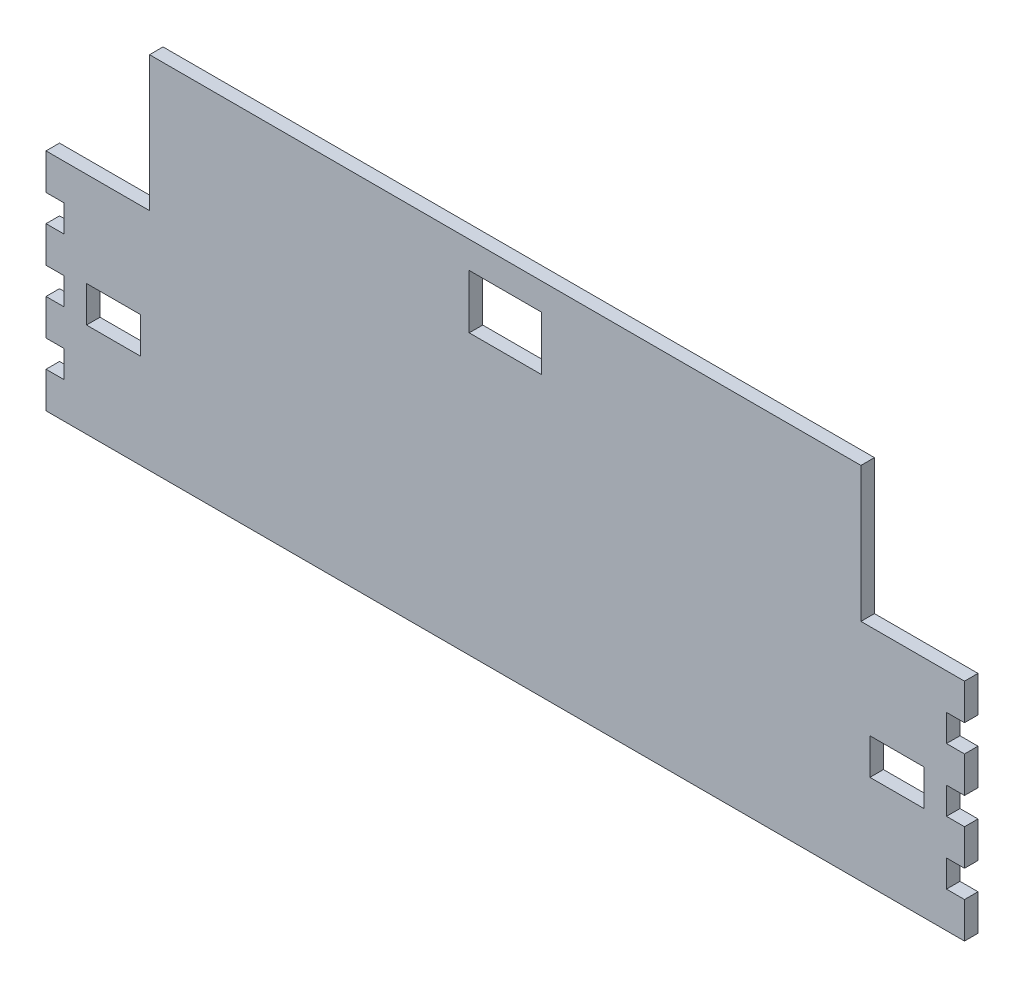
ISO-10303-21;
HEADER;
FILE_DESCRIPTION(('STEP AP214'),'2;1');
FILE_NAME('part.step','',(''),(''),'','','');
FILE_SCHEMA(('AUTOMOTIVE_DESIGN { 1 0 10303 214 1 1 1 1 }'));
ENDSEC;
DATA;
#1=APPLICATION_CONTEXT('core data for automotive mechanical design processes');
#2=APPLICATION_PROTOCOL_DEFINITION('international standard','automotive_design',2000,#1);
#3=PRODUCT_CONTEXT('',#1,'mechanical');
#4=PRODUCT('Part','Part','',(#3));
#5=PRODUCT_RELATED_PRODUCT_CATEGORY('part','',(#4));
#6=PRODUCT_DEFINITION_FORMATION('','',#4);
#7=PRODUCT_DEFINITION_CONTEXT('part definition',#1,'design');
#8=PRODUCT_DEFINITION('design','',#6,#7);
#9=PRODUCT_DEFINITION_SHAPE('','',#8);
#10=(LENGTH_UNIT() NAMED_UNIT(*) SI_UNIT(.MILLI.,.METRE.));
#11=(NAMED_UNIT(*) PLANE_ANGLE_UNIT() SI_UNIT($,.RADIAN.));
#12=(NAMED_UNIT(*) SI_UNIT($,.STERADIAN.) SOLID_ANGLE_UNIT());
#13=UNCERTAINTY_MEASURE_WITH_UNIT(LENGTH_MEASURE(1.E-05),#10,'distance_accuracy_value','');
#14=(GEOMETRIC_REPRESENTATION_CONTEXT(3) GLOBAL_UNCERTAINTY_ASSIGNED_CONTEXT((#13)) GLOBAL_UNIT_ASSIGNED_CONTEXT((#10,
#11,#12)) REPRESENTATION_CONTEXT('',''));
#15=CARTESIAN_POINT('',(0.,0.,0.));
#16=DIRECTION('',(0.,0.,1.));
#17=DIRECTION('',(1.,0.,0.));
#18=AXIS2_PLACEMENT_3D('',#15,#16,#17);
#19=CARTESIAN_POINT('',(510.,70.,15.));
#20=DIRECTION('',(0.,0.,1.));
#21=DIRECTION('',(1.,0.,0.));
#22=AXIS2_PLACEMENT_3D('',#19,#20,#21);
#23=PLANE('',#22);
#24=DIRECTION('',(1.,0.,0.));
#25=VECTOR('',#24,1.);
#26=CARTESIAN_POINT('',(-465.,105.,15.));
#27=LINE('',#26,#25);
#28=CARTESIAN_POINT('',(-465.,105.,15.));
#29=VERTEX_POINT('',#28);
#30=CARTESIAN_POINT('',(-405.,105.,15.));
#31=VERTEX_POINT('',#30);
#32=EDGE_CURVE('E360',#29,#31,#27,.T.);
#33=ORIENTED_EDGE('',*,*,#32,.F.);
#34=DIRECTION('',(0.,-1.,0.));
#35=VECTOR('',#34,1.);
#36=CARTESIAN_POINT('',(-465.,145.,15.));
#37=LINE('',#36,#35);
#38=CARTESIAN_POINT('',(-465.,145.,15.));
#39=VERTEX_POINT('',#38);
#40=EDGE_CURVE('E358',#39,#29,#37,.T.);
#41=ORIENTED_EDGE('',*,*,#40,.F.);
#42=DIRECTION('',(-1.,0.,0.));
#43=VECTOR('',#42,1.);
#44=CARTESIAN_POINT('',(-465.,145.,15.));
#45=LINE('',#44,#43);
#46=CARTESIAN_POINT('',(-405.,145.,15.));
#47=VERTEX_POINT('',#46);
#48=EDGE_CURVE('E365',#47,#39,#45,.T.);
#49=ORIENTED_EDGE('',*,*,#48,.F.);
#50=DIRECTION('',(0.,1.,0.));
#51=VECTOR('',#50,1.);
#52=CARTESIAN_POINT('',(-405.,145.,15.));
#53=LINE('',#52,#51);
#54=EDGE_CURVE('E362',#31,#47,#53,.T.);
#55=ORIENTED_EDGE('',*,*,#54,.F.);
#56=EDGE_LOOP('',(#33,#41,#49,#55));
#57=FACE_BOUND('',#56,.T.);
#58=DIRECTION('',(1.,0.,0.));
#59=VECTOR('',#58,1.);
#60=CARTESIAN_POINT('',(490.,70.,15.));
#61=LINE('',#60,#59);
#62=CARTESIAN_POINT('',(490.,70.,15.));
#63=VERTEX_POINT('',#62);
#64=CARTESIAN_POINT('',(510.,70.,15.));
#65=VERTEX_POINT('',#64);
#66=EDGE_CURVE('E473',#63,#65,#61,.T.);
#67=ORIENTED_EDGE('',*,*,#66,.T.);
#68=DIRECTION('',(0.,1.,0.));
#69=VECTOR('',#68,1.);
#70=CARTESIAN_POINT('',(510.,70.,15.));
#71=LINE('',#70,#69);
#72=CARTESIAN_POINT('',(510.,110.,15.));
#73=VERTEX_POINT('',#72);
#74=EDGE_CURVE('E476',#65,#73,#71,.T.);
#75=ORIENTED_EDGE('',*,*,#74,.T.);
#76=DIRECTION('',(-1.,0.,0.));
#77=VECTOR('',#76,1.);
#78=CARTESIAN_POINT('',(510.,110.,15.));
#79=LINE('',#78,#77);
#80=CARTESIAN_POINT('',(490.,110.,15.));
#81=VERTEX_POINT('',#80);
#82=EDGE_CURVE('E478',#73,#81,#79,.T.);
#83=ORIENTED_EDGE('',*,*,#82,.T.);
#84=DIRECTION('',(0.,1.,0.));
#85=VECTOR('',#84,1.);
#86=CARTESIAN_POINT('',(490.,110.,15.));
#87=LINE('',#86,#85);
#88=CARTESIAN_POINT('',(490.,140.,15.));
#89=VERTEX_POINT('',#88);
#90=EDGE_CURVE('E480',#81,#89,#87,.T.);
#91=ORIENTED_EDGE('',*,*,#90,.T.);
#92=DIRECTION('',(1.,0.,0.));
#93=VECTOR('',#92,1.);
#94=CARTESIAN_POINT('',(490.,140.,15.));
#95=LINE('',#94,#93);
#96=CARTESIAN_POINT('',(510.,140.,15.));
#97=VERTEX_POINT('',#96);
#98=EDGE_CURVE('E482',#89,#97,#95,.T.);
#99=ORIENTED_EDGE('',*,*,#98,.T.);
#100=DIRECTION('',(0.,1.,0.));
#101=VECTOR('',#100,1.);
#102=CARTESIAN_POINT('',(510.,140.,15.));
#103=LINE('',#102,#101);
#104=CARTESIAN_POINT('',(510.,180.,15.));
#105=VERTEX_POINT('',#104);
#106=EDGE_CURVE('E484',#97,#105,#103,.T.);
#107=ORIENTED_EDGE('',*,*,#106,.T.);
#108=DIRECTION('',(-1.,0.,0.));
#109=VECTOR('',#108,1.);
#110=CARTESIAN_POINT('',(510.,180.,15.));
#111=LINE('',#110,#109);
#112=CARTESIAN_POINT('',(490.,180.,15.));
#113=VERTEX_POINT('',#112);
#114=EDGE_CURVE('E486',#105,#113,#111,.T.);
#115=ORIENTED_EDGE('',*,*,#114,.T.);
#116=DIRECTION('',(0.,1.,0.));
#117=VECTOR('',#116,1.);
#118=CARTESIAN_POINT('',(490.,180.,15.));
#119=LINE('',#118,#117);
#120=CARTESIAN_POINT('',(490.,210.,15.));
#121=VERTEX_POINT('',#120);
#122=EDGE_CURVE('E488',#113,#121,#119,.T.);
#123=ORIENTED_EDGE('',*,*,#122,.T.);
#124=DIRECTION('',(1.,0.,0.));
#125=VECTOR('',#124,1.);
#126=CARTESIAN_POINT('',(490.,210.,15.));
#127=LINE('',#126,#125);
#128=CARTESIAN_POINT('',(510.,210.,15.));
#129=VERTEX_POINT('',#128);
#130=EDGE_CURVE('E490',#121,#129,#127,.T.);
#131=ORIENTED_EDGE('',*,*,#130,.T.);
#132=DIRECTION('',(0.,1.,0.));
#133=VECTOR('',#132,1.);
#134=CARTESIAN_POINT('',(510.,210.,15.));
#135=LINE('',#134,#133);
#136=CARTESIAN_POINT('',(510.,250.,15.));
#137=VERTEX_POINT('',#136);
#138=EDGE_CURVE('E492',#129,#137,#135,.T.);
#139=ORIENTED_EDGE('',*,*,#138,.T.);
#140=DIRECTION('',(-1.,0.,0.));
#141=VECTOR('',#140,1.);
#142=CARTESIAN_POINT('',(510.,250.,15.));
#143=LINE('',#142,#141);
#144=CARTESIAN_POINT('',(395.,250.,15.));
#145=VERTEX_POINT('',#144);
#146=EDGE_CURVE('E494',#137,#145,#143,.T.);
#147=ORIENTED_EDGE('',*,*,#146,.T.);
#148=DIRECTION('',(0.,1.,0.));
#149=VECTOR('',#148,1.);
#150=CARTESIAN_POINT('',(395.,250.,15.));
#151=LINE('',#150,#149);
#152=CARTESIAN_POINT('',(395.,400.,15.));
#153=VERTEX_POINT('',#152);
#154=EDGE_CURVE('E496',#145,#153,#151,.T.);
#155=ORIENTED_EDGE('',*,*,#154,.T.);
#156=DIRECTION('',(-1.,0.,0.));
#157=VECTOR('',#156,1.);
#158=CARTESIAN_POINT('',(395.,400.,15.));
#159=LINE('',#158,#157);
#160=CARTESIAN_POINT('',(-395.,400.,15.));
#161=VERTEX_POINT('',#160);
#162=EDGE_CURVE('E498',#153,#161,#159,.T.);
#163=ORIENTED_EDGE('',*,*,#162,.T.);
#164=DIRECTION('',(0.,-1.,0.));
#165=VECTOR('',#164,1.);
#166=CARTESIAN_POINT('',(-395.,250.,15.));
#167=LINE('',#166,#165);
#168=CARTESIAN_POINT('',(-395.,250.,15.));
#169=VERTEX_POINT('',#168);
#170=EDGE_CURVE('E500',#161,#169,#167,.T.);
#171=ORIENTED_EDGE('',*,*,#170,.T.);
#172=DIRECTION('',(-1.,0.,0.));
#173=VECTOR('',#172,1.);
#174=CARTESIAN_POINT('',(-510.,250.,15.));
#175=LINE('',#174,#173);
#176=CARTESIAN_POINT('',(-510.,250.,15.));
#177=VERTEX_POINT('',#176);
#178=EDGE_CURVE('E502',#169,#177,#175,.T.);
#179=ORIENTED_EDGE('',*,*,#178,.T.);
#180=DIRECTION('',(0.,-1.,0.));
#181=VECTOR('',#180,1.);
#182=CARTESIAN_POINT('',(-510.,210.,15.));
#183=LINE('',#182,#181);
#184=CARTESIAN_POINT('',(-510.,210.,15.));
#185=VERTEX_POINT('',#184);
#186=EDGE_CURVE('E504',#177,#185,#183,.T.);
#187=ORIENTED_EDGE('',*,*,#186,.T.);
#188=DIRECTION('',(1.,0.,0.));
#189=VECTOR('',#188,1.);
#190=CARTESIAN_POINT('',(-490.,210.,15.));
#191=LINE('',#190,#189);
#192=CARTESIAN_POINT('',(-490.,210.,15.));
#193=VERTEX_POINT('',#192);
#194=EDGE_CURVE('E506',#185,#193,#191,.T.);
#195=ORIENTED_EDGE('',*,*,#194,.T.);
#196=DIRECTION('',(0.,-1.,0.));
#197=VECTOR('',#196,1.);
#198=CARTESIAN_POINT('',(-490.,180.,15.));
#199=LINE('',#198,#197);
#200=CARTESIAN_POINT('',(-490.,180.,15.));
#201=VERTEX_POINT('',#200);
#202=EDGE_CURVE('E508',#193,#201,#199,.T.);
#203=ORIENTED_EDGE('',*,*,#202,.T.);
#204=DIRECTION('',(-1.,0.,0.));
#205=VECTOR('',#204,1.);
#206=CARTESIAN_POINT('',(-510.,180.,15.));
#207=LINE('',#206,#205);
#208=CARTESIAN_POINT('',(-510.,180.,15.));
#209=VERTEX_POINT('',#208);
#210=EDGE_CURVE('E510',#201,#209,#207,.T.);
#211=ORIENTED_EDGE('',*,*,#210,.T.);
#212=DIRECTION('',(0.,-1.,0.));
#213=VECTOR('',#212,1.);
#214=CARTESIAN_POINT('',(-510.,140.,15.));
#215=LINE('',#214,#213);
#216=CARTESIAN_POINT('',(-510.,140.,15.));
#217=VERTEX_POINT('',#216);
#218=EDGE_CURVE('E512',#209,#217,#215,.T.);
#219=ORIENTED_EDGE('',*,*,#218,.T.);
#220=DIRECTION('',(1.,0.,0.));
#221=VECTOR('',#220,1.);
#222=CARTESIAN_POINT('',(-490.,140.,15.));
#223=LINE('',#222,#221);
#224=CARTESIAN_POINT('',(-490.,140.,15.));
#225=VERTEX_POINT('',#224);
#226=EDGE_CURVE('E514',#217,#225,#223,.T.);
#227=ORIENTED_EDGE('',*,*,#226,.T.);
#228=DIRECTION('',(0.,-1.,0.));
#229=VECTOR('',#228,1.);
#230=CARTESIAN_POINT('',(-490.,110.,15.));
#231=LINE('',#230,#229);
#232=CARTESIAN_POINT('',(-490.,110.,15.));
#233=VERTEX_POINT('',#232);
#234=EDGE_CURVE('E516',#225,#233,#231,.T.);
#235=ORIENTED_EDGE('',*,*,#234,.T.);
#236=DIRECTION('',(-1.,0.,0.));
#237=VECTOR('',#236,1.);
#238=CARTESIAN_POINT('',(-510.,110.,15.));
#239=LINE('',#238,#237);
#240=CARTESIAN_POINT('',(-510.,110.,15.));
#241=VERTEX_POINT('',#240);
#242=EDGE_CURVE('E518',#233,#241,#239,.T.);
#243=ORIENTED_EDGE('',*,*,#242,.T.);
#244=DIRECTION('',(0.,-1.,0.));
#245=VECTOR('',#244,1.);
#246=CARTESIAN_POINT('',(-510.,70.,15.));
#247=LINE('',#246,#245);
#248=CARTESIAN_POINT('',(-510.,70.,15.));
#249=VERTEX_POINT('',#248);
#250=EDGE_CURVE('E520',#241,#249,#247,.T.);
#251=ORIENTED_EDGE('',*,*,#250,.T.);
#252=DIRECTION('',(1.,0.,0.));
#253=VECTOR('',#252,1.);
#254=CARTESIAN_POINT('',(-490.,70.,15.));
#255=LINE('',#254,#253);
#256=CARTESIAN_POINT('',(-490.,70.,15.));
#257=VERTEX_POINT('',#256);
#258=EDGE_CURVE('E522',#249,#257,#255,.T.);
#259=ORIENTED_EDGE('',*,*,#258,.T.);
#260=DIRECTION('',(0.,-1.,0.));
#261=VECTOR('',#260,1.);
#262=CARTESIAN_POINT('',(-490.,40.,15.));
#263=LINE('',#262,#261);
#264=CARTESIAN_POINT('',(-490.,40.,15.));
#265=VERTEX_POINT('',#264);
#266=EDGE_CURVE('E524',#257,#265,#263,.T.);
#267=ORIENTED_EDGE('',*,*,#266,.T.);
#268=DIRECTION('',(-1.,0.,0.));
#269=VECTOR('',#268,1.);
#270=CARTESIAN_POINT('',(-510.,40.,15.));
#271=LINE('',#270,#269);
#272=CARTESIAN_POINT('',(-510.,40.,15.));
#273=VERTEX_POINT('',#272);
#274=EDGE_CURVE('E526',#265,#273,#271,.T.);
#275=ORIENTED_EDGE('',*,*,#274,.T.);
#276=DIRECTION('',(0.,-1.,0.));
#277=VECTOR('',#276,1.);
#278=CARTESIAN_POINT('',(-510.,0.,15.));
#279=LINE('',#278,#277);
#280=CARTESIAN_POINT('',(-510.,0.,15.));
#281=VERTEX_POINT('',#280);
#282=EDGE_CURVE('E528',#273,#281,#279,.T.);
#283=ORIENTED_EDGE('',*,*,#282,.T.);
#284=DIRECTION('',(1.,0.,0.));
#285=VECTOR('',#284,1.);
#286=CARTESIAN_POINT('',(-510.,0.,15.));
#287=LINE('',#286,#285);
#288=CARTESIAN_POINT('',(510.,0.,15.));
#289=VERTEX_POINT('',#288);
#290=EDGE_CURVE('E530',#281,#289,#287,.T.);
#291=ORIENTED_EDGE('',*,*,#290,.T.);
#292=DIRECTION('',(0.,1.,0.));
#293=VECTOR('',#292,1.);
#294=CARTESIAN_POINT('',(510.,0.,15.));
#295=LINE('',#294,#293);
#296=CARTESIAN_POINT('',(510.,40.,15.));
#297=VERTEX_POINT('',#296);
#298=EDGE_CURVE('E532',#289,#297,#295,.T.);
#299=ORIENTED_EDGE('',*,*,#298,.T.);
#300=DIRECTION('',(-1.,0.,0.));
#301=VECTOR('',#300,1.);
#302=CARTESIAN_POINT('',(510.,40.,15.));
#303=LINE('',#302,#301);
#304=CARTESIAN_POINT('',(490.,40.,15.));
#305=VERTEX_POINT('',#304);
#306=EDGE_CURVE('E534',#297,#305,#303,.T.);
#307=ORIENTED_EDGE('',*,*,#306,.T.);
#308=DIRECTION('',(0.,1.,0.));
#309=VECTOR('',#308,1.);
#310=CARTESIAN_POINT('',(490.,40.,15.));
#311=LINE('',#310,#309);
#312=EDGE_CURVE('E536',#305,#63,#311,.T.);
#313=ORIENTED_EDGE('',*,*,#312,.T.);
#314=EDGE_LOOP('',(#67,#75,#83,#91,#99,#107,#115,#123,#131,#139,#147,#155,#163,#171,#179,#187,
#195,#203,#211,#219,#227,#235,#243,#251,#259,#267,#275,#283,#291,#299,#307,#313));
#315=FACE_BOUND('',#314,.T.);
#316=DIRECTION('',(1.,0.,0.));
#317=VECTOR('',#316,1.);
#318=CARTESIAN_POINT('',(-40.,310.,15.));
#319=LINE('',#318,#317);
#320=CARTESIAN_POINT('',(-40.,310.,15.));
#321=VERTEX_POINT('',#320);
#322=CARTESIAN_POINT('',(40.,310.,15.));
#323=VERTEX_POINT('',#322);
#324=EDGE_CURVE('E391',#321,#323,#319,.T.);
#325=ORIENTED_EDGE('',*,*,#324,.F.);
#326=DIRECTION('',(0.,-1.,0.));
#327=VECTOR('',#326,1.);
#328=CARTESIAN_POINT('',(-40.,310.,15.));
#329=LINE('',#328,#327);
#330=CARTESIAN_POINT('',(-40.,370.,15.));
#331=VERTEX_POINT('',#330);
#332=EDGE_CURVE('E389',#331,#321,#329,.T.);
#333=ORIENTED_EDGE('',*,*,#332,.F.);
#334=DIRECTION('',(-1.,0.,0.));
#335=VECTOR('',#334,1.);
#336=CARTESIAN_POINT('',(40.,370.,15.));
#337=LINE('',#336,#335);
#338=CARTESIAN_POINT('',(40.,370.,15.));
#339=VERTEX_POINT('',#338);
#340=EDGE_CURVE('E396',#339,#331,#337,.T.);
#341=ORIENTED_EDGE('',*,*,#340,.F.);
#342=DIRECTION('',(0.,1.,0.));
#343=VECTOR('',#342,1.);
#344=CARTESIAN_POINT('',(40.,310.,15.));
#345=LINE('',#344,#343);
#346=EDGE_CURVE('E393',#323,#339,#345,.T.);
#347=ORIENTED_EDGE('',*,*,#346,.F.);
#348=EDGE_LOOP('',(#325,#333,#341,#347));
#349=FACE_BOUND('',#348,.T.);
#350=DIRECTION('',(0.,-1.,0.));
#351=VECTOR('',#350,1.);
#352=CARTESIAN_POINT('',(405.,145.,15.));
#353=LINE('',#352,#351);
#354=CARTESIAN_POINT('',(405.,145.,15.));
#355=VERTEX_POINT('',#354);
#356=CARTESIAN_POINT('',(405.,105.,15.));
#357=VERTEX_POINT('',#356);
#358=EDGE_CURVE('E337',#355,#357,#353,.T.);
#359=ORIENTED_EDGE('',*,*,#358,.F.);
#360=DIRECTION('',(-1.,0.,0.));
#361=VECTOR('',#360,1.);
#362=CARTESIAN_POINT('',(465.,145.,15.));
#363=LINE('',#362,#361);
#364=CARTESIAN_POINT('',(465.,145.,15.));
#365=VERTEX_POINT('',#364);
#366=EDGE_CURVE('E326',#365,#355,#363,.T.);
#367=ORIENTED_EDGE('',*,*,#366,.F.);
#368=DIRECTION('',(0.,1.,0.));
#369=VECTOR('',#368,1.);
#370=CARTESIAN_POINT('',(465.,145.,15.));
#371=LINE('',#370,#369);
#372=CARTESIAN_POINT('',(465.,105.,15.));
#373=VERTEX_POINT('',#372);
#374=EDGE_CURVE('E341',#373,#365,#371,.T.);
#375=ORIENTED_EDGE('',*,*,#374,.F.);
#376=DIRECTION('',(1.,0.,0.));
#377=VECTOR('',#376,1.);
#378=CARTESIAN_POINT('',(465.,105.,15.));
#379=LINE('',#378,#377);
#380=EDGE_CURVE('E339',#357,#373,#379,.T.);
#381=ORIENTED_EDGE('',*,*,#380,.F.);
#382=EDGE_LOOP('',(#359,#367,#375,#381));
#383=FACE_BOUND('',#382,.T.);
#384=ADVANCED_FACE('F30',(#57,#315,#349,#383),#23,.T.);
#385=CARTESIAN_POINT('',(510.,70.,0.));
#386=DIRECTION('',(0.,0.,1.));
#387=DIRECTION('',(1.,0.,0.));
#388=AXIS2_PLACEMENT_3D('',#385,#386,#387);
#389=PLANE('',#388);
#390=DIRECTION('',(0.,-1.,0.));
#391=VECTOR('',#390,1.);
#392=CARTESIAN_POINT('',(-465.,145.,0.));
#393=LINE('',#392,#391);
#394=CARTESIAN_POINT('',(-465.,145.,0.));
#395=VERTEX_POINT('',#394);
#396=CARTESIAN_POINT('',(-465.,105.,0.));
#397=VERTEX_POINT('',#396);
#398=EDGE_CURVE('E327',#395,#397,#393,.T.);
#399=ORIENTED_EDGE('',*,*,#398,.T.);
#400=DIRECTION('',(1.,0.,0.));
#401=VECTOR('',#400,1.);
#402=CARTESIAN_POINT('',(-465.,105.,0.));
#403=LINE('',#402,#401);
#404=CARTESIAN_POINT('',(-405.,105.,0.));
#405=VERTEX_POINT('',#404);
#406=EDGE_CURVE('E349',#397,#405,#403,.T.);
#407=ORIENTED_EDGE('',*,*,#406,.T.);
#408=DIRECTION('',(0.,1.,0.));
#409=VECTOR('',#408,1.);
#410=CARTESIAN_POINT('',(-405.,145.,0.));
#411=LINE('',#410,#409);
#412=CARTESIAN_POINT('',(-405.,145.,0.));
#413=VERTEX_POINT('',#412);
#414=EDGE_CURVE('E352',#405,#413,#411,.T.);
#415=ORIENTED_EDGE('',*,*,#414,.T.);
#416=DIRECTION('',(-1.,0.,0.));
#417=VECTOR('',#416,1.);
#418=CARTESIAN_POINT('',(-465.,145.,0.));
#419=LINE('',#418,#417);
#420=EDGE_CURVE('E355',#413,#395,#419,.T.);
#421=ORIENTED_EDGE('',*,*,#420,.T.);
#422=EDGE_LOOP('',(#399,#407,#415,#421));
#423=FACE_BOUND('',#422,.T.);
#424=DIRECTION('',(1.,0.,0.));
#425=VECTOR('',#424,1.);
#426=CARTESIAN_POINT('',(490.,70.,0.));
#427=LINE('',#426,#425);
#428=CARTESIAN_POINT('',(490.,70.,0.));
#429=VERTEX_POINT('',#428);
#430=CARTESIAN_POINT('',(510.,70.,0.));
#431=VERTEX_POINT('',#430);
#432=EDGE_CURVE('E408',#429,#431,#427,.T.);
#433=ORIENTED_EDGE('',*,*,#432,.F.);
#434=DIRECTION('',(0.,1.,0.));
#435=VECTOR('',#434,1.);
#436=CARTESIAN_POINT('',(490.,40.,0.));
#437=LINE('',#436,#435);
#438=CARTESIAN_POINT('',(490.,40.,0.));
#439=VERTEX_POINT('',#438);
#440=EDGE_CURVE('E471',#439,#429,#437,.T.);
#441=ORIENTED_EDGE('',*,*,#440,.F.);
#442=DIRECTION('',(-1.,0.,0.));
#443=VECTOR('',#442,1.);
#444=CARTESIAN_POINT('',(510.,40.,0.));
#445=LINE('',#444,#443);
#446=CARTESIAN_POINT('',(510.,40.,0.));
#447=VERTEX_POINT('',#446);
#448=EDGE_CURVE('E469',#447,#439,#445,.T.);
#449=ORIENTED_EDGE('',*,*,#448,.F.);
#450=DIRECTION('',(0.,1.,0.));
#451=VECTOR('',#450,1.);
#452=CARTESIAN_POINT('',(510.,0.,0.));
#453=LINE('',#452,#451);
#454=CARTESIAN_POINT('',(510.,0.,0.));
#455=VERTEX_POINT('',#454);
#456=EDGE_CURVE('E467',#455,#447,#453,.T.);
#457=ORIENTED_EDGE('',*,*,#456,.F.);
#458=DIRECTION('',(1.,0.,0.));
#459=VECTOR('',#458,1.);
#460=CARTESIAN_POINT('',(-510.,0.,0.));
#461=LINE('',#460,#459);
#462=CARTESIAN_POINT('',(-510.,0.,0.));
#463=VERTEX_POINT('',#462);
#464=EDGE_CURVE('E465',#463,#455,#461,.T.);
#465=ORIENTED_EDGE('',*,*,#464,.F.);
#466=DIRECTION('',(0.,-1.,0.));
#467=VECTOR('',#466,1.);
#468=CARTESIAN_POINT('',(-510.,0.,0.));
#469=LINE('',#468,#467);
#470=CARTESIAN_POINT('',(-510.,40.,0.));
#471=VERTEX_POINT('',#470);
#472=EDGE_CURVE('E463',#471,#463,#469,.T.);
#473=ORIENTED_EDGE('',*,*,#472,.F.);
#474=DIRECTION('',(-1.,0.,0.));
#475=VECTOR('',#474,1.);
#476=CARTESIAN_POINT('',(-510.,40.,0.));
#477=LINE('',#476,#475);
#478=CARTESIAN_POINT('',(-490.,40.,0.));
#479=VERTEX_POINT('',#478);
#480=EDGE_CURVE('E461',#479,#471,#477,.T.);
#481=ORIENTED_EDGE('',*,*,#480,.F.);
#482=DIRECTION('',(0.,-1.,0.));
#483=VECTOR('',#482,1.);
#484=CARTESIAN_POINT('',(-490.,40.,0.));
#485=LINE('',#484,#483);
#486=CARTESIAN_POINT('',(-490.,70.,0.));
#487=VERTEX_POINT('',#486);
#488=EDGE_CURVE('E459',#487,#479,#485,.T.);
#489=ORIENTED_EDGE('',*,*,#488,.F.);
#490=DIRECTION('',(1.,0.,0.));
#491=VECTOR('',#490,1.);
#492=CARTESIAN_POINT('',(-490.,70.,0.));
#493=LINE('',#492,#491);
#494=CARTESIAN_POINT('',(-510.,70.,0.));
#495=VERTEX_POINT('',#494);
#496=EDGE_CURVE('E457',#495,#487,#493,.T.);
#497=ORIENTED_EDGE('',*,*,#496,.F.);
#498=DIRECTION('',(0.,-1.,0.));
#499=VECTOR('',#498,1.);
#500=CARTESIAN_POINT('',(-510.,70.,0.));
#501=LINE('',#500,#499);
#502=CARTESIAN_POINT('',(-510.,110.,0.));
#503=VERTEX_POINT('',#502);
#504=EDGE_CURVE('E455',#503,#495,#501,.T.);
#505=ORIENTED_EDGE('',*,*,#504,.F.);
#506=DIRECTION('',(-1.,0.,0.));
#507=VECTOR('',#506,1.);
#508=CARTESIAN_POINT('',(-510.,110.,0.));
#509=LINE('',#508,#507);
#510=CARTESIAN_POINT('',(-490.,110.,0.));
#511=VERTEX_POINT('',#510);
#512=EDGE_CURVE('E453',#511,#503,#509,.T.);
#513=ORIENTED_EDGE('',*,*,#512,.F.);
#514=DIRECTION('',(0.,-1.,0.));
#515=VECTOR('',#514,1.);
#516=CARTESIAN_POINT('',(-490.,110.,0.));
#517=LINE('',#516,#515);
#518=CARTESIAN_POINT('',(-490.,140.,0.));
#519=VERTEX_POINT('',#518);
#520=EDGE_CURVE('E451',#519,#511,#517,.T.);
#521=ORIENTED_EDGE('',*,*,#520,.F.);
#522=DIRECTION('',(1.,0.,0.));
#523=VECTOR('',#522,1.);
#524=CARTESIAN_POINT('',(-490.,140.,0.));
#525=LINE('',#524,#523);
#526=CARTESIAN_POINT('',(-510.,140.,0.));
#527=VERTEX_POINT('',#526);
#528=EDGE_CURVE('E449',#527,#519,#525,.T.);
#529=ORIENTED_EDGE('',*,*,#528,.F.);
#530=DIRECTION('',(0.,-1.,0.));
#531=VECTOR('',#530,1.);
#532=CARTESIAN_POINT('',(-510.,140.,0.));
#533=LINE('',#532,#531);
#534=CARTESIAN_POINT('',(-510.,180.,0.));
#535=VERTEX_POINT('',#534);
#536=EDGE_CURVE('E447',#535,#527,#533,.T.);
#537=ORIENTED_EDGE('',*,*,#536,.F.);
#538=DIRECTION('',(-1.,0.,0.));
#539=VECTOR('',#538,1.);
#540=CARTESIAN_POINT('',(-510.,180.,0.));
#541=LINE('',#540,#539);
#542=CARTESIAN_POINT('',(-490.,180.,0.));
#543=VERTEX_POINT('',#542);
#544=EDGE_CURVE('E445',#543,#535,#541,.T.);
#545=ORIENTED_EDGE('',*,*,#544,.F.);
#546=DIRECTION('',(0.,-1.,0.));
#547=VECTOR('',#546,1.);
#548=CARTESIAN_POINT('',(-490.,180.,0.));
#549=LINE('',#548,#547);
#550=CARTESIAN_POINT('',(-490.,210.,0.));
#551=VERTEX_POINT('',#550);
#552=EDGE_CURVE('E443',#551,#543,#549,.T.);
#553=ORIENTED_EDGE('',*,*,#552,.F.);
#554=DIRECTION('',(1.,0.,0.));
#555=VECTOR('',#554,1.);
#556=CARTESIAN_POINT('',(-490.,210.,0.));
#557=LINE('',#556,#555);
#558=CARTESIAN_POINT('',(-510.,210.,0.));
#559=VERTEX_POINT('',#558);
#560=EDGE_CURVE('E441',#559,#551,#557,.T.);
#561=ORIENTED_EDGE('',*,*,#560,.F.);
#562=DIRECTION('',(0.,-1.,0.));
#563=VECTOR('',#562,1.);
#564=CARTESIAN_POINT('',(-510.,210.,0.));
#565=LINE('',#564,#563);
#566=CARTESIAN_POINT('',(-510.,250.,0.));
#567=VERTEX_POINT('',#566);
#568=EDGE_CURVE('E439',#567,#559,#565,.T.);
#569=ORIENTED_EDGE('',*,*,#568,.F.);
#570=DIRECTION('',(-1.,0.,0.));
#571=VECTOR('',#570,1.);
#572=CARTESIAN_POINT('',(-510.,250.,0.));
#573=LINE('',#572,#571);
#574=CARTESIAN_POINT('',(-395.,250.,0.));
#575=VERTEX_POINT('',#574);
#576=EDGE_CURVE('E437',#575,#567,#573,.T.);
#577=ORIENTED_EDGE('',*,*,#576,.F.);
#578=DIRECTION('',(0.,-1.,0.));
#579=VECTOR('',#578,1.);
#580=CARTESIAN_POINT('',(-395.,250.,0.));
#581=LINE('',#580,#579);
#582=CARTESIAN_POINT('',(-395.,400.,0.));
#583=VERTEX_POINT('',#582);
#584=EDGE_CURVE('E435',#583,#575,#581,.T.);
#585=ORIENTED_EDGE('',*,*,#584,.F.);
#586=DIRECTION('',(-1.,0.,0.));
#587=VECTOR('',#586,1.);
#588=CARTESIAN_POINT('',(395.,400.,0.));
#589=LINE('',#588,#587);
#590=CARTESIAN_POINT('',(395.,400.,0.));
#591=VERTEX_POINT('',#590);
#592=EDGE_CURVE('E433',#591,#583,#589,.T.);
#593=ORIENTED_EDGE('',*,*,#592,.F.);
#594=DIRECTION('',(0.,1.,0.));
#595=VECTOR('',#594,1.);
#596=CARTESIAN_POINT('',(395.,250.,0.));
#597=LINE('',#596,#595);
#598=CARTESIAN_POINT('',(395.,250.,0.));
#599=VERTEX_POINT('',#598);
#600=EDGE_CURVE('E431',#599,#591,#597,.T.);
#601=ORIENTED_EDGE('',*,*,#600,.F.);
#602=DIRECTION('',(-1.,0.,0.));
#603=VECTOR('',#602,1.);
#604=CARTESIAN_POINT('',(510.,250.,0.));
#605=LINE('',#604,#603);
#606=CARTESIAN_POINT('',(510.,250.,0.));
#607=VERTEX_POINT('',#606);
#608=EDGE_CURVE('E429',#607,#599,#605,.T.);
#609=ORIENTED_EDGE('',*,*,#608,.F.);
#610=DIRECTION('',(0.,1.,0.));
#611=VECTOR('',#610,1.);
#612=CARTESIAN_POINT('',(510.,210.,0.));
#613=LINE('',#612,#611);
#614=CARTESIAN_POINT('',(510.,210.,0.));
#615=VERTEX_POINT('',#614);
#616=EDGE_CURVE('E427',#615,#607,#613,.T.);
#617=ORIENTED_EDGE('',*,*,#616,.F.);
#618=DIRECTION('',(1.,0.,0.));
#619=VECTOR('',#618,1.);
#620=CARTESIAN_POINT('',(490.,210.,0.));
#621=LINE('',#620,#619);
#622=CARTESIAN_POINT('',(490.,210.,0.));
#623=VERTEX_POINT('',#622);
#624=EDGE_CURVE('E425',#623,#615,#621,.T.);
#625=ORIENTED_EDGE('',*,*,#624,.F.);
#626=DIRECTION('',(0.,1.,0.));
#627=VECTOR('',#626,1.);
#628=CARTESIAN_POINT('',(490.,180.,0.));
#629=LINE('',#628,#627);
#630=CARTESIAN_POINT('',(490.,180.,0.));
#631=VERTEX_POINT('',#630);
#632=EDGE_CURVE('E423',#631,#623,#629,.T.);
#633=ORIENTED_EDGE('',*,*,#632,.F.);
#634=DIRECTION('',(-1.,0.,0.));
#635=VECTOR('',#634,1.);
#636=CARTESIAN_POINT('',(510.,180.,0.));
#637=LINE('',#636,#635);
#638=CARTESIAN_POINT('',(510.,180.,0.));
#639=VERTEX_POINT('',#638);
#640=EDGE_CURVE('E421',#639,#631,#637,.T.);
#641=ORIENTED_EDGE('',*,*,#640,.F.);
#642=DIRECTION('',(0.,1.,0.));
#643=VECTOR('',#642,1.);
#644=CARTESIAN_POINT('',(510.,140.,0.));
#645=LINE('',#644,#643);
#646=CARTESIAN_POINT('',(510.,140.,0.));
#647=VERTEX_POINT('',#646);
#648=EDGE_CURVE('E419',#647,#639,#645,.T.);
#649=ORIENTED_EDGE('',*,*,#648,.F.);
#650=DIRECTION('',(1.,0.,0.));
#651=VECTOR('',#650,1.);
#652=CARTESIAN_POINT('',(490.,140.,0.));
#653=LINE('',#652,#651);
#654=CARTESIAN_POINT('',(490.,140.,0.));
#655=VERTEX_POINT('',#654);
#656=EDGE_CURVE('E417',#655,#647,#653,.T.);
#657=ORIENTED_EDGE('',*,*,#656,.F.);
#658=DIRECTION('',(0.,1.,0.));
#659=VECTOR('',#658,1.);
#660=CARTESIAN_POINT('',(490.,110.,0.));
#661=LINE('',#660,#659);
#662=CARTESIAN_POINT('',(490.,110.,0.));
#663=VERTEX_POINT('',#662);
#664=EDGE_CURVE('E415',#663,#655,#661,.T.);
#665=ORIENTED_EDGE('',*,*,#664,.F.);
#666=DIRECTION('',(-1.,0.,0.));
#667=VECTOR('',#666,1.);
#668=CARTESIAN_POINT('',(510.,110.,0.));
#669=LINE('',#668,#667);
#670=CARTESIAN_POINT('',(510.,110.,0.));
#671=VERTEX_POINT('',#670);
#672=EDGE_CURVE('E413',#671,#663,#669,.T.);
#673=ORIENTED_EDGE('',*,*,#672,.F.);
#674=DIRECTION('',(0.,1.,0.));
#675=VECTOR('',#674,1.);
#676=CARTESIAN_POINT('',(510.,70.,0.));
#677=LINE('',#676,#675);
#678=EDGE_CURVE('E411',#431,#671,#677,.T.);
#679=ORIENTED_EDGE('',*,*,#678,.F.);
#680=EDGE_LOOP('',(#433,#441,#449,#457,#465,#473,#481,#489,#497,#505,#513,#521,#529,#537,#545,
#553,#561,#569,#577,#585,#593,#601,#609,#617,#625,#633,#641,#649,#657,#665,#673,#679));
#681=FACE_BOUND('',#680,.T.);
#682=DIRECTION('',(0.,-1.,0.));
#683=VECTOR('',#682,1.);
#684=CARTESIAN_POINT('',(-40.,310.,0.));
#685=LINE('',#684,#683);
#686=CARTESIAN_POINT('',(-40.,370.,0.));
#687=VERTEX_POINT('',#686);
#688=CARTESIAN_POINT('',(-40.,310.,0.));
#689=VERTEX_POINT('',#688);
#690=EDGE_CURVE('E377',#687,#689,#685,.T.);
#691=ORIENTED_EDGE('',*,*,#690,.T.);
#692=DIRECTION('',(1.,0.,0.));
#693=VECTOR('',#692,1.);
#694=CARTESIAN_POINT('',(-40.,310.,0.));
#695=LINE('',#694,#693);
#696=CARTESIAN_POINT('',(40.,310.,0.));
#697=VERTEX_POINT('',#696);
#698=EDGE_CURVE('E380',#689,#697,#695,.T.);
#699=ORIENTED_EDGE('',*,*,#698,.T.);
#700=DIRECTION('',(0.,1.,0.));
#701=VECTOR('',#700,1.);
#702=CARTESIAN_POINT('',(40.,310.,0.));
#703=LINE('',#702,#701);
#704=CARTESIAN_POINT('',(40.,370.,0.));
#705=VERTEX_POINT('',#704);
#706=EDGE_CURVE('E383',#697,#705,#703,.T.);
#707=ORIENTED_EDGE('',*,*,#706,.T.);
#708=DIRECTION('',(-1.,0.,0.));
#709=VECTOR('',#708,1.);
#710=CARTESIAN_POINT('',(40.,370.,0.));
#711=LINE('',#710,#709);
#712=EDGE_CURVE('E386',#705,#687,#711,.T.);
#713=ORIENTED_EDGE('',*,*,#712,.T.);
#714=EDGE_LOOP('',(#691,#699,#707,#713));
#715=FACE_BOUND('',#714,.T.);
#716=DIRECTION('',(-1.,0.,0.));
#717=VECTOR('',#716,1.);
#718=CARTESIAN_POINT('',(465.,145.,0.));
#719=LINE('',#718,#717);
#720=CARTESIAN_POINT('',(465.,145.,0.));
#721=VERTEX_POINT('',#720);
#722=CARTESIAN_POINT('',(405.,145.,0.));
#723=VERTEX_POINT('',#722);
#724=EDGE_CURVE('E53',#721,#723,#719,.T.);
#725=ORIENTED_EDGE('',*,*,#724,.T.);
#726=DIRECTION('',(0.,-1.,0.));
#727=VECTOR('',#726,1.);
#728=CARTESIAN_POINT('',(405.,145.,0.));
#729=LINE('',#728,#727);
#730=CARTESIAN_POINT('',(405.,105.,0.));
#731=VERTEX_POINT('',#730);
#732=EDGE_CURVE('E313',#723,#731,#729,.T.);
#733=ORIENTED_EDGE('',*,*,#732,.T.);
#734=DIRECTION('',(1.,0.,0.));
#735=VECTOR('',#734,1.);
#736=CARTESIAN_POINT('',(465.,105.,0.));
#737=LINE('',#736,#735);
#738=CARTESIAN_POINT('',(465.,105.,0.));
#739=VERTEX_POINT('',#738);
#740=EDGE_CURVE('E322',#731,#739,#737,.T.);
#741=ORIENTED_EDGE('',*,*,#740,.T.);
#742=DIRECTION('',(0.,1.,0.));
#743=VECTOR('',#742,1.);
#744=CARTESIAN_POINT('',(465.,145.,0.));
#745=LINE('',#744,#743);
#746=EDGE_CURVE('E331',#739,#721,#745,.T.);
#747=ORIENTED_EDGE('',*,*,#746,.T.);
#748=EDGE_LOOP('',(#725,#733,#741,#747));
#749=FACE_BOUND('',#748,.T.);
#750=ADVANCED_FACE('F330',(#423,#681,#715,#749),#389,.F.);
#751=CARTESIAN_POINT('',(490.,70.,15.));
#752=DIRECTION('',(0.,1.,0.));
#753=DIRECTION('',(0.,0.,1.));
#754=AXIS2_PLACEMENT_3D('',#751,#752,#753);
#755=PLANE('',#754);
#756=ORIENTED_EDGE('',*,*,#432,.T.);
#757=DIRECTION('',(0.,0.,-1.));
#758=VECTOR('',#757,1.);
#759=CARTESIAN_POINT('',(510.,70.,15.));
#760=LINE('',#759,#758);
#761=EDGE_CURVE('E11',#65,#431,#760,.T.);
#762=ORIENTED_EDGE('',*,*,#761,.F.);
#763=ORIENTED_EDGE('',*,*,#66,.F.);
#764=DIRECTION('',(0.,0.,-1.));
#765=VECTOR('',#764,1.);
#766=CARTESIAN_POINT('',(490.,70.,15.));
#767=LINE('',#766,#765);
#768=EDGE_CURVE('E538',#63,#429,#767,.T.);
#769=ORIENTED_EDGE('',*,*,#768,.T.);
#770=EDGE_LOOP('',(#756,#762,#763,#769));
#771=FACE_BOUND('',#770,.T.);
#772=ADVANCED_FACE('F32',(#771),#755,.F.);
#773=CARTESIAN_POINT('',(510.,70.,15.));
#774=DIRECTION('',(-1.,0.,0.));
#775=DIRECTION('',(0.,0.,1.));
#776=AXIS2_PLACEMENT_3D('',#773,#774,#775);
#777=PLANE('',#776);
#778=ORIENTED_EDGE('',*,*,#678,.T.);
#779=DIRECTION('',(0.,0.,-1.));
#780=VECTOR('',#779,1.);
#781=CARTESIAN_POINT('',(510.,110.,15.));
#782=LINE('',#781,#780);
#783=EDGE_CURVE('E38',#73,#671,#782,.T.);
#784=ORIENTED_EDGE('',*,*,#783,.F.);
#785=ORIENTED_EDGE('',*,*,#74,.F.);
#786=ORIENTED_EDGE('',*,*,#761,.T.);
#787=EDGE_LOOP('',(#778,#784,#785,#786));
#788=FACE_BOUND('',#787,.T.);
#789=ADVANCED_FACE('F655',(#788),#777,.F.);
#790=CARTESIAN_POINT('',(510.,110.,15.));
#791=DIRECTION('',(0.,-1.,0.));
#792=DIRECTION('',(0.,0.,-1.));
#793=AXIS2_PLACEMENT_3D('',#790,#791,#792);
#794=PLANE('',#793);
#795=ORIENTED_EDGE('',*,*,#672,.T.);
#796=DIRECTION('',(0.,0.,-1.));
#797=VECTOR('',#796,1.);
#798=CARTESIAN_POINT('',(490.,110.,15.));
#799=LINE('',#798,#797);
#800=EDGE_CURVE('E625',#81,#663,#799,.T.);
#801=ORIENTED_EDGE('',*,*,#800,.F.);
#802=ORIENTED_EDGE('',*,*,#82,.F.);
#803=ORIENTED_EDGE('',*,*,#783,.T.);
#804=EDGE_LOOP('',(#795,#801,#802,#803));
#805=FACE_BOUND('',#804,.T.);
#806=ADVANCED_FACE('F632',(#805),#794,.F.);
#807=CARTESIAN_POINT('',(490.,110.,15.));
#808=DIRECTION('',(-1.,0.,0.));
#809=DIRECTION('',(0.,0.,1.));
#810=AXIS2_PLACEMENT_3D('',#807,#808,#809);
#811=PLANE('',#810);
#812=ORIENTED_EDGE('',*,*,#664,.T.);
#813=DIRECTION('',(0.,0.,-1.));
#814=VECTOR('',#813,1.);
#815=CARTESIAN_POINT('',(490.,140.,15.));
#816=LINE('',#815,#814);
#817=EDGE_CURVE('E622',#89,#655,#816,.T.);
#818=ORIENTED_EDGE('',*,*,#817,.F.);
#819=ORIENTED_EDGE('',*,*,#90,.F.);
#820=ORIENTED_EDGE('',*,*,#800,.T.);
#821=EDGE_LOOP('',(#812,#818,#819,#820));
#822=FACE_BOUND('',#821,.T.);
#823=ADVANCED_FACE('F643',(#822),#811,.F.);
#824=CARTESIAN_POINT('',(490.,140.,15.));
#825=DIRECTION('',(0.,1.,0.));
#826=DIRECTION('',(0.,0.,1.));
#827=AXIS2_PLACEMENT_3D('',#824,#825,#826);
#828=PLANE('',#827);
#829=ORIENTED_EDGE('',*,*,#656,.T.);
#830=DIRECTION('',(0.,0.,-1.));
#831=VECTOR('',#830,1.);
#832=CARTESIAN_POINT('',(510.,140.,15.));
#833=LINE('',#832,#831);
#834=EDGE_CURVE('E619',#97,#647,#833,.T.);
#835=ORIENTED_EDGE('',*,*,#834,.F.);
#836=ORIENTED_EDGE('',*,*,#98,.F.);
#837=ORIENTED_EDGE('',*,*,#817,.T.);
#838=EDGE_LOOP('',(#829,#835,#836,#837));
#839=FACE_BOUND('',#838,.T.);
#840=ADVANCED_FACE('F647',(#839),#828,.F.);
#841=CARTESIAN_POINT('',(510.,140.,15.));
#842=DIRECTION('',(-1.,0.,0.));
#843=DIRECTION('',(0.,0.,1.));
#844=AXIS2_PLACEMENT_3D('',#841,#842,#843);
#845=PLANE('',#844);
#846=ORIENTED_EDGE('',*,*,#648,.T.);
#847=DIRECTION('',(0.,0.,-1.));
#848=VECTOR('',#847,1.);
#849=CARTESIAN_POINT('',(510.,180.,15.));
#850=LINE('',#849,#848);
#851=EDGE_CURVE('E616',#105,#639,#850,.T.);
#852=ORIENTED_EDGE('',*,*,#851,.F.);
#853=ORIENTED_EDGE('',*,*,#106,.F.);
#854=ORIENTED_EDGE('',*,*,#834,.T.);
#855=EDGE_LOOP('',(#846,#852,#853,#854));
#856=FACE_BOUND('',#855,.T.);
#857=ADVANCED_FACE('F788',(#856),#845,.F.);
#858=CARTESIAN_POINT('',(510.,180.,15.));
#859=DIRECTION('',(0.,-1.,0.));
#860=DIRECTION('',(0.,0.,-1.));
#861=AXIS2_PLACEMENT_3D('',#858,#859,#860);
#862=PLANE('',#861);
#863=ORIENTED_EDGE('',*,*,#640,.T.);
#864=DIRECTION('',(0.,0.,-1.));
#865=VECTOR('',#864,1.);
#866=CARTESIAN_POINT('',(490.,180.,15.));
#867=LINE('',#866,#865);
#868=EDGE_CURVE('E613',#113,#631,#867,.T.);
#869=ORIENTED_EDGE('',*,*,#868,.F.);
#870=ORIENTED_EDGE('',*,*,#114,.F.);
#871=ORIENTED_EDGE('',*,*,#851,.T.);
#872=EDGE_LOOP('',(#863,#869,#870,#871));
#873=FACE_BOUND('',#872,.T.);
#874=ADVANCED_FACE('F786',(#873),#862,.F.);
#875=CARTESIAN_POINT('',(490.,180.,15.));
#876=DIRECTION('',(-1.,0.,0.));
#877=DIRECTION('',(0.,0.,1.));
#878=AXIS2_PLACEMENT_3D('',#875,#876,#877);
#879=PLANE('',#878);
#880=ORIENTED_EDGE('',*,*,#632,.T.);
#881=DIRECTION('',(0.,0.,-1.));
#882=VECTOR('',#881,1.);
#883=CARTESIAN_POINT('',(490.,210.,15.));
#884=LINE('',#883,#882);
#885=EDGE_CURVE('E610',#121,#623,#884,.T.);
#886=ORIENTED_EDGE('',*,*,#885,.F.);
#887=ORIENTED_EDGE('',*,*,#122,.F.);
#888=ORIENTED_EDGE('',*,*,#868,.T.);
#889=EDGE_LOOP('',(#880,#886,#887,#888));
#890=FACE_BOUND('',#889,.T.);
#891=ADVANCED_FACE('F781',(#890),#879,.F.);
#892=CARTESIAN_POINT('',(490.,210.,15.));
#893=DIRECTION('',(0.,1.,0.));
#894=DIRECTION('',(-1.,0.,0.));
#895=AXIS2_PLACEMENT_3D('',#892,#893,#894);
#896=PLANE('',#895);
#897=ORIENTED_EDGE('',*,*,#624,.T.);
#898=DIRECTION('',(0.,0.,-1.));
#899=VECTOR('',#898,1.);
#900=CARTESIAN_POINT('',(510.,210.,15.));
#901=LINE('',#900,#899);
#902=EDGE_CURVE('E607',#129,#615,#901,.T.);
#903=ORIENTED_EDGE('',*,*,#902,.F.);
#904=ORIENTED_EDGE('',*,*,#130,.F.);
#905=ORIENTED_EDGE('',*,*,#885,.T.);
#906=EDGE_LOOP('',(#897,#903,#904,#905));
#907=FACE_BOUND('',#906,.T.);
#908=ADVANCED_FACE('F776',(#907),#896,.F.);
#909=CARTESIAN_POINT('',(510.,210.,15.));
#910=DIRECTION('',(-1.,0.,0.));
#911=DIRECTION('',(0.,0.,1.));
#912=AXIS2_PLACEMENT_3D('',#909,#910,#911);
#913=PLANE('',#912);
#914=ORIENTED_EDGE('',*,*,#616,.T.);
#915=DIRECTION('',(0.,0.,-1.));
#916=VECTOR('',#915,1.);
#917=CARTESIAN_POINT('',(510.,250.,15.));
#918=LINE('',#917,#916);
#919=EDGE_CURVE('E604',#137,#607,#918,.T.);
#920=ORIENTED_EDGE('',*,*,#919,.F.);
#921=ORIENTED_EDGE('',*,*,#138,.F.);
#922=ORIENTED_EDGE('',*,*,#902,.T.);
#923=EDGE_LOOP('',(#914,#920,#921,#922));
#924=FACE_BOUND('',#923,.T.);
#925=ADVANCED_FACE('F772',(#924),#913,.F.);
#926=CARTESIAN_POINT('',(510.,250.,15.));
#927=DIRECTION('',(0.,-1.,0.));
#928=DIRECTION('',(1.,0.,0.));
#929=AXIS2_PLACEMENT_3D('',#926,#927,#928);
#930=PLANE('',#929);
#931=ORIENTED_EDGE('',*,*,#608,.T.);
#932=DIRECTION('',(0.,0.,-1.));
#933=VECTOR('',#932,1.);
#934=CARTESIAN_POINT('',(395.,250.,15.));
#935=LINE('',#934,#933);
#936=EDGE_CURVE('E601',#145,#599,#935,.T.);
#937=ORIENTED_EDGE('',*,*,#936,.F.);
#938=ORIENTED_EDGE('',*,*,#146,.F.);
#939=ORIENTED_EDGE('',*,*,#919,.T.);
#940=EDGE_LOOP('',(#931,#937,#938,#939));
#941=FACE_BOUND('',#940,.T.);
#942=ADVANCED_FACE('F767',(#941),#930,.F.);
#943=CARTESIAN_POINT('',(395.,250.,15.));
#944=DIRECTION('',(-1.,0.,0.));
#945=DIRECTION('',(0.,0.,1.));
#946=AXIS2_PLACEMENT_3D('',#943,#944,#945);
#947=PLANE('',#946);
#948=ORIENTED_EDGE('',*,*,#600,.T.);
#949=DIRECTION('',(0.,0.,-1.));
#950=VECTOR('',#949,1.);
#951=CARTESIAN_POINT('',(395.,400.,15.));
#952=LINE('',#951,#950);
#953=EDGE_CURVE('E598',#153,#591,#952,.T.);
#954=ORIENTED_EDGE('',*,*,#953,.F.);
#955=ORIENTED_EDGE('',*,*,#154,.F.);
#956=ORIENTED_EDGE('',*,*,#936,.T.);
#957=EDGE_LOOP('',(#948,#954,#955,#956));
#958=FACE_BOUND('',#957,.T.);
#959=ADVANCED_FACE('F761',(#958),#947,.F.);
#960=CARTESIAN_POINT('',(395.,400.,15.));
#961=DIRECTION('',(0.,-1.,0.));
#962=DIRECTION('',(0.,0.,-1.));
#963=AXIS2_PLACEMENT_3D('',#960,#961,#962);
#964=PLANE('',#963);
#965=ORIENTED_EDGE('',*,*,#592,.T.);
#966=DIRECTION('',(0.,0.,-1.));
#967=VECTOR('',#966,1.);
#968=CARTESIAN_POINT('',(-395.,400.,15.));
#969=LINE('',#968,#967);
#970=EDGE_CURVE('E595',#161,#583,#969,.T.);
#971=ORIENTED_EDGE('',*,*,#970,.F.);
#972=ORIENTED_EDGE('',*,*,#162,.F.);
#973=ORIENTED_EDGE('',*,*,#953,.T.);
#974=EDGE_LOOP('',(#965,#971,#972,#973));
#975=FACE_BOUND('',#974,.T.);
#976=ADVANCED_FACE('F757',(#975),#964,.F.);
#977=CARTESIAN_POINT('',(-395.,250.,15.));
#978=DIRECTION('',(1.,0.,0.));
#979=DIRECTION('',(0.,0.,-1.));
#980=AXIS2_PLACEMENT_3D('',#977,#978,#979);
#981=PLANE('',#980);
#982=ORIENTED_EDGE('',*,*,#584,.T.);
#983=DIRECTION('',(0.,0.,-1.));
#984=VECTOR('',#983,1.);
#985=CARTESIAN_POINT('',(-395.,250.,15.));
#986=LINE('',#985,#984);
#987=EDGE_CURVE('E592',#169,#575,#986,.T.);
#988=ORIENTED_EDGE('',*,*,#987,.F.);
#989=ORIENTED_EDGE('',*,*,#170,.F.);
#990=ORIENTED_EDGE('',*,*,#970,.T.);
#991=EDGE_LOOP('',(#982,#988,#989,#990));
#992=FACE_BOUND('',#991,.T.);
#993=ADVANCED_FACE('F752',(#992),#981,.F.);
#994=CARTESIAN_POINT('',(-510.,250.,15.));
#995=DIRECTION('',(0.,-1.,0.));
#996=DIRECTION('',(1.,0.,0.));
#997=AXIS2_PLACEMENT_3D('',#994,#995,#996);
#998=PLANE('',#997);
#999=ORIENTED_EDGE('',*,*,#576,.T.);
#1000=DIRECTION('',(0.,0.,-1.));
#1001=VECTOR('',#1000,1.);
#1002=CARTESIAN_POINT('',(-510.,250.,15.));
#1003=LINE('',#1002,#1001);
#1004=EDGE_CURVE('E589',#177,#567,#1003,.T.);
#1005=ORIENTED_EDGE('',*,*,#1004,.F.);
#1006=ORIENTED_EDGE('',*,*,#178,.F.);
#1007=ORIENTED_EDGE('',*,*,#987,.T.);
#1008=EDGE_LOOP('',(#999,#1005,#1006,#1007));
#1009=FACE_BOUND('',#1008,.T.);
#1010=ADVANCED_FACE('F746',(#1009),#998,.F.);
#1011=CARTESIAN_POINT('',(-510.,210.,15.));
#1012=DIRECTION('',(1.,0.,0.));
#1013=DIRECTION('',(0.,0.,-1.));
#1014=AXIS2_PLACEMENT_3D('',#1011,#1012,#1013);
#1015=PLANE('',#1014);
#1016=ORIENTED_EDGE('',*,*,#568,.T.);
#1017=DIRECTION('',(0.,0.,-1.));
#1018=VECTOR('',#1017,1.);
#1019=CARTESIAN_POINT('',(-510.,210.,15.));
#1020=LINE('',#1019,#1018);
#1021=EDGE_CURVE('E586',#185,#559,#1020,.T.);
#1022=ORIENTED_EDGE('',*,*,#1021,.F.);
#1023=ORIENTED_EDGE('',*,*,#186,.F.);
#1024=ORIENTED_EDGE('',*,*,#1004,.T.);
#1025=EDGE_LOOP('',(#1016,#1022,#1023,#1024));
#1026=FACE_BOUND('',#1025,.T.);
#1027=ADVANCED_FACE('F742',(#1026),#1015,.F.);
#1028=CARTESIAN_POINT('',(-490.,210.,15.));
#1029=DIRECTION('',(0.,1.,0.));
#1030=DIRECTION('',(-1.,0.,0.));
#1031=AXIS2_PLACEMENT_3D('',#1028,#1029,#1030);
#1032=PLANE('',#1031);
#1033=ORIENTED_EDGE('',*,*,#560,.T.);
#1034=DIRECTION('',(0.,0.,-1.));
#1035=VECTOR('',#1034,1.);
#1036=CARTESIAN_POINT('',(-490.,210.,15.));
#1037=LINE('',#1036,#1035);
#1038=EDGE_CURVE('E583',#193,#551,#1037,.T.);
#1039=ORIENTED_EDGE('',*,*,#1038,.F.);
#1040=ORIENTED_EDGE('',*,*,#194,.F.);
#1041=ORIENTED_EDGE('',*,*,#1021,.T.);
#1042=EDGE_LOOP('',(#1033,#1039,#1040,#1041));
#1043=FACE_BOUND('',#1042,.T.);
#1044=ADVANCED_FACE('F737',(#1043),#1032,.F.);
#1045=CARTESIAN_POINT('',(-490.,180.,15.));
#1046=DIRECTION('',(1.,0.,0.));
#1047=DIRECTION('',(0.,0.,-1.));
#1048=AXIS2_PLACEMENT_3D('',#1045,#1046,#1047);
#1049=PLANE('',#1048);
#1050=ORIENTED_EDGE('',*,*,#552,.T.);
#1051=DIRECTION('',(0.,0.,-1.));
#1052=VECTOR('',#1051,1.);
#1053=CARTESIAN_POINT('',(-490.,180.,15.));
#1054=LINE('',#1053,#1052);
#1055=EDGE_CURVE('E580',#201,#543,#1054,.T.);
#1056=ORIENTED_EDGE('',*,*,#1055,.F.);
#1057=ORIENTED_EDGE('',*,*,#202,.F.);
#1058=ORIENTED_EDGE('',*,*,#1038,.T.);
#1059=EDGE_LOOP('',(#1050,#1056,#1057,#1058));
#1060=FACE_BOUND('',#1059,.T.);
#1061=ADVANCED_FACE('F731',(#1060),#1049,.F.);
#1062=CARTESIAN_POINT('',(-510.,180.,15.));
#1063=DIRECTION('',(0.,-1.,0.));
#1064=DIRECTION('',(0.,0.,-1.));
#1065=AXIS2_PLACEMENT_3D('',#1062,#1063,#1064);
#1066=PLANE('',#1065);
#1067=ORIENTED_EDGE('',*,*,#544,.T.);
#1068=DIRECTION('',(0.,0.,-1.));
#1069=VECTOR('',#1068,1.);
#1070=CARTESIAN_POINT('',(-510.,180.,15.));
#1071=LINE('',#1070,#1069);
#1072=EDGE_CURVE('E577',#209,#535,#1071,.T.);
#1073=ORIENTED_EDGE('',*,*,#1072,.F.);
#1074=ORIENTED_EDGE('',*,*,#210,.F.);
#1075=ORIENTED_EDGE('',*,*,#1055,.T.);
#1076=EDGE_LOOP('',(#1067,#1073,#1074,#1075));
#1077=FACE_BOUND('',#1076,.T.);
#1078=ADVANCED_FACE('F727',(#1077),#1066,.F.);
#1079=CARTESIAN_POINT('',(-510.,140.,15.));
#1080=DIRECTION('',(1.,0.,0.));
#1081=DIRECTION('',(0.,0.,-1.));
#1082=AXIS2_PLACEMENT_3D('',#1079,#1080,#1081);
#1083=PLANE('',#1082);
#1084=ORIENTED_EDGE('',*,*,#536,.T.);
#1085=DIRECTION('',(0.,0.,-1.));
#1086=VECTOR('',#1085,1.);
#1087=CARTESIAN_POINT('',(-510.,140.,15.));
#1088=LINE('',#1087,#1086);
#1089=EDGE_CURVE('E574',#217,#527,#1088,.T.);
#1090=ORIENTED_EDGE('',*,*,#1089,.F.);
#1091=ORIENTED_EDGE('',*,*,#218,.F.);
#1092=ORIENTED_EDGE('',*,*,#1072,.T.);
#1093=EDGE_LOOP('',(#1084,#1090,#1091,#1092));
#1094=FACE_BOUND('',#1093,.T.);
#1095=ADVANCED_FACE('F722',(#1094),#1083,.F.);
#1096=CARTESIAN_POINT('',(-490.,140.,15.));
#1097=DIRECTION('',(0.,1.,0.));
#1098=DIRECTION('',(0.,0.,1.));
#1099=AXIS2_PLACEMENT_3D('',#1096,#1097,#1098);
#1100=PLANE('',#1099);
#1101=ORIENTED_EDGE('',*,*,#528,.T.);
#1102=DIRECTION('',(0.,0.,-1.));
#1103=VECTOR('',#1102,1.);
#1104=CARTESIAN_POINT('',(-490.,140.,15.));
#1105=LINE('',#1104,#1103);
#1106=EDGE_CURVE('E571',#225,#519,#1105,.T.);
#1107=ORIENTED_EDGE('',*,*,#1106,.F.);
#1108=ORIENTED_EDGE('',*,*,#226,.F.);
#1109=ORIENTED_EDGE('',*,*,#1089,.T.);
#1110=EDGE_LOOP('',(#1101,#1107,#1108,#1109));
#1111=FACE_BOUND('',#1110,.T.);
#1112=ADVANCED_FACE('F716',(#1111),#1100,.F.);
#1113=CARTESIAN_POINT('',(-490.,110.,15.));
#1114=DIRECTION('',(1.,0.,0.));
#1115=DIRECTION('',(0.,0.,-1.));
#1116=AXIS2_PLACEMENT_3D('',#1113,#1114,#1115);
#1117=PLANE('',#1116);
#1118=ORIENTED_EDGE('',*,*,#520,.T.);
#1119=DIRECTION('',(0.,0.,-1.));
#1120=VECTOR('',#1119,1.);
#1121=CARTESIAN_POINT('',(-490.,110.,15.));
#1122=LINE('',#1121,#1120);
#1123=EDGE_CURVE('E568',#233,#511,#1122,.T.);
#1124=ORIENTED_EDGE('',*,*,#1123,.F.);
#1125=ORIENTED_EDGE('',*,*,#234,.F.);
#1126=ORIENTED_EDGE('',*,*,#1106,.T.);
#1127=EDGE_LOOP('',(#1118,#1124,#1125,#1126));
#1128=FACE_BOUND('',#1127,.T.);
#1129=ADVANCED_FACE('F712',(#1128),#1117,.F.);
#1130=CARTESIAN_POINT('',(-510.,110.,15.));
#1131=DIRECTION('',(0.,-1.,0.));
#1132=DIRECTION('',(0.,0.,-1.));
#1133=AXIS2_PLACEMENT_3D('',#1130,#1131,#1132);
#1134=PLANE('',#1133);
#1135=ORIENTED_EDGE('',*,*,#512,.T.);
#1136=DIRECTION('',(0.,0.,-1.));
#1137=VECTOR('',#1136,1.);
#1138=CARTESIAN_POINT('',(-510.,110.,15.));
#1139=LINE('',#1138,#1137);
#1140=EDGE_CURVE('E565',#241,#503,#1139,.T.);
#1141=ORIENTED_EDGE('',*,*,#1140,.F.);
#1142=ORIENTED_EDGE('',*,*,#242,.F.);
#1143=ORIENTED_EDGE('',*,*,#1123,.T.);
#1144=EDGE_LOOP('',(#1135,#1141,#1142,#1143));
#1145=FACE_BOUND('',#1144,.T.);
#1146=ADVANCED_FACE('F707',(#1145),#1134,.F.);
#1147=CARTESIAN_POINT('',(-510.,70.,15.));
#1148=DIRECTION('',(1.,0.,0.));
#1149=DIRECTION('',(0.,0.,-1.));
#1150=AXIS2_PLACEMENT_3D('',#1147,#1148,#1149);
#1151=PLANE('',#1150);
#1152=ORIENTED_EDGE('',*,*,#504,.T.);
#1153=DIRECTION('',(0.,0.,-1.));
#1154=VECTOR('',#1153,1.);
#1155=CARTESIAN_POINT('',(-510.,70.,15.));
#1156=LINE('',#1155,#1154);
#1157=EDGE_CURVE('E562',#249,#495,#1156,.T.);
#1158=ORIENTED_EDGE('',*,*,#1157,.F.);
#1159=ORIENTED_EDGE('',*,*,#250,.F.);
#1160=ORIENTED_EDGE('',*,*,#1140,.T.);
#1161=EDGE_LOOP('',(#1152,#1158,#1159,#1160));
#1162=FACE_BOUND('',#1161,.T.);
#1163=ADVANCED_FACE('F701',(#1162),#1151,.F.);
#1164=CARTESIAN_POINT('',(-490.,70.,15.));
#1165=DIRECTION('',(0.,1.,0.));
#1166=DIRECTION('',(0.,0.,1.));
#1167=AXIS2_PLACEMENT_3D('',#1164,#1165,#1166);
#1168=PLANE('',#1167);
#1169=ORIENTED_EDGE('',*,*,#496,.T.);
#1170=DIRECTION('',(0.,0.,-1.));
#1171=VECTOR('',#1170,1.);
#1172=CARTESIAN_POINT('',(-490.,70.,15.));
#1173=LINE('',#1172,#1171);
#1174=EDGE_CURVE('E559',#257,#487,#1173,.T.);
#1175=ORIENTED_EDGE('',*,*,#1174,.F.);
#1176=ORIENTED_EDGE('',*,*,#258,.F.);
#1177=ORIENTED_EDGE('',*,*,#1157,.T.);
#1178=EDGE_LOOP('',(#1169,#1175,#1176,#1177));
#1179=FACE_BOUND('',#1178,.T.);
#1180=ADVANCED_FACE('F697',(#1179),#1168,.F.);
#1181=CARTESIAN_POINT('',(-490.,40.,15.));
#1182=DIRECTION('',(1.,0.,0.));
#1183=DIRECTION('',(0.,0.,-1.));
#1184=AXIS2_PLACEMENT_3D('',#1181,#1182,#1183);
#1185=PLANE('',#1184);
#1186=ORIENTED_EDGE('',*,*,#488,.T.);
#1187=DIRECTION('',(0.,0.,-1.));
#1188=VECTOR('',#1187,1.);
#1189=CARTESIAN_POINT('',(-490.,40.,15.));
#1190=LINE('',#1189,#1188);
#1191=EDGE_CURVE('E556',#265,#479,#1190,.T.);
#1192=ORIENTED_EDGE('',*,*,#1191,.F.);
#1193=ORIENTED_EDGE('',*,*,#266,.F.);
#1194=ORIENTED_EDGE('',*,*,#1174,.T.);
#1195=EDGE_LOOP('',(#1186,#1192,#1193,#1194));
#1196=FACE_BOUND('',#1195,.T.);
#1197=ADVANCED_FACE('F692',(#1196),#1185,.F.);
#1198=CARTESIAN_POINT('',(-510.,40.,15.));
#1199=DIRECTION('',(0.,-1.,0.));
#1200=DIRECTION('',(0.,0.,-1.));
#1201=AXIS2_PLACEMENT_3D('',#1198,#1199,#1200);
#1202=PLANE('',#1201);
#1203=ORIENTED_EDGE('',*,*,#480,.T.);
#1204=DIRECTION('',(0.,0.,-1.));
#1205=VECTOR('',#1204,1.);
#1206=CARTESIAN_POINT('',(-510.,40.,15.));
#1207=LINE('',#1206,#1205);
#1208=EDGE_CURVE('E553',#273,#471,#1207,.T.);
#1209=ORIENTED_EDGE('',*,*,#1208,.F.);
#1210=ORIENTED_EDGE('',*,*,#274,.F.);
#1211=ORIENTED_EDGE('',*,*,#1191,.T.);
#1212=EDGE_LOOP('',(#1203,#1209,#1210,#1211));
#1213=FACE_BOUND('',#1212,.T.);
#1214=ADVANCED_FACE('F686',(#1213),#1202,.F.);
#1215=CARTESIAN_POINT('',(-510.,0.,15.));
#1216=DIRECTION('',(1.,0.,0.));
#1217=DIRECTION('',(0.,0.,-1.));
#1218=AXIS2_PLACEMENT_3D('',#1215,#1216,#1217);
#1219=PLANE('',#1218);
#1220=ORIENTED_EDGE('',*,*,#472,.T.);
#1221=DIRECTION('',(0.,0.,-1.));
#1222=VECTOR('',#1221,1.);
#1223=CARTESIAN_POINT('',(-510.,0.,15.));
#1224=LINE('',#1223,#1222);
#1225=EDGE_CURVE('E550',#281,#463,#1224,.T.);
#1226=ORIENTED_EDGE('',*,*,#1225,.F.);
#1227=ORIENTED_EDGE('',*,*,#282,.F.);
#1228=ORIENTED_EDGE('',*,*,#1208,.T.);
#1229=EDGE_LOOP('',(#1220,#1226,#1227,#1228));
#1230=FACE_BOUND('',#1229,.T.);
#1231=ADVANCED_FACE('F682',(#1230),#1219,.F.);
#1232=CARTESIAN_POINT('',(-510.,0.,15.));
#1233=DIRECTION('',(0.,1.,0.));
#1234=DIRECTION('',(0.,0.,1.));
#1235=AXIS2_PLACEMENT_3D('',#1232,#1233,#1234);
#1236=PLANE('',#1235);
#1237=ORIENTED_EDGE('',*,*,#464,.T.);
#1238=DIRECTION('',(0.,0.,-1.));
#1239=VECTOR('',#1238,1.);
#1240=CARTESIAN_POINT('',(510.,0.,15.));
#1241=LINE('',#1240,#1239);
#1242=EDGE_CURVE('E547',#289,#455,#1241,.T.);
#1243=ORIENTED_EDGE('',*,*,#1242,.F.);
#1244=ORIENTED_EDGE('',*,*,#290,.F.);
#1245=ORIENTED_EDGE('',*,*,#1225,.T.);
#1246=EDGE_LOOP('',(#1237,#1243,#1244,#1245));
#1247=FACE_BOUND('',#1246,.T.);
#1248=ADVANCED_FACE('F677',(#1247),#1236,.F.);
#1249=CARTESIAN_POINT('',(510.,0.,15.));
#1250=DIRECTION('',(-1.,0.,0.));
#1251=DIRECTION('',(0.,0.,1.));
#1252=AXIS2_PLACEMENT_3D('',#1249,#1250,#1251);
#1253=PLANE('',#1252);
#1254=ORIENTED_EDGE('',*,*,#456,.T.);
#1255=DIRECTION('',(0.,0.,-1.));
#1256=VECTOR('',#1255,1.);
#1257=CARTESIAN_POINT('',(510.,40.,15.));
#1258=LINE('',#1257,#1256);
#1259=EDGE_CURVE('E544',#297,#447,#1258,.T.);
#1260=ORIENTED_EDGE('',*,*,#1259,.F.);
#1261=ORIENTED_EDGE('',*,*,#298,.F.);
#1262=ORIENTED_EDGE('',*,*,#1242,.T.);
#1263=EDGE_LOOP('',(#1254,#1260,#1261,#1262));
#1264=FACE_BOUND('',#1263,.T.);
#1265=ADVANCED_FACE('F671',(#1264),#1253,.F.);
#1266=CARTESIAN_POINT('',(510.,40.,15.));
#1267=DIRECTION('',(0.,-1.,0.));
#1268=DIRECTION('',(0.,0.,-1.));
#1269=AXIS2_PLACEMENT_3D('',#1266,#1267,#1268);
#1270=PLANE('',#1269);
#1271=ORIENTED_EDGE('',*,*,#448,.T.);
#1272=DIRECTION('',(0.,0.,-1.));
#1273=VECTOR('',#1272,1.);
#1274=CARTESIAN_POINT('',(490.,40.,15.));
#1275=LINE('',#1274,#1273);
#1276=EDGE_CURVE('E541',#305,#439,#1275,.T.);
#1277=ORIENTED_EDGE('',*,*,#1276,.F.);
#1278=ORIENTED_EDGE('',*,*,#306,.F.);
#1279=ORIENTED_EDGE('',*,*,#1259,.T.);
#1280=EDGE_LOOP('',(#1271,#1277,#1278,#1279));
#1281=FACE_BOUND('',#1280,.T.);
#1282=ADVANCED_FACE('F667',(#1281),#1270,.F.);
#1283=CARTESIAN_POINT('',(490.,40.,15.));
#1284=DIRECTION('',(-1.,0.,0.));
#1285=DIRECTION('',(0.,0.,1.));
#1286=AXIS2_PLACEMENT_3D('',#1283,#1284,#1285);
#1287=PLANE('',#1286);
#1288=ORIENTED_EDGE('',*,*,#440,.T.);
#1289=ORIENTED_EDGE('',*,*,#768,.F.);
#1290=ORIENTED_EDGE('',*,*,#312,.F.);
#1291=ORIENTED_EDGE('',*,*,#1276,.T.);
#1292=EDGE_LOOP('',(#1288,#1289,#1290,#1291));
#1293=FACE_BOUND('',#1292,.T.);
#1294=ADVANCED_FACE('F662',(#1293),#1287,.F.);
#1295=CARTESIAN_POINT('',(-40.,310.,15.));
#1296=DIRECTION('',(1.,0.,0.));
#1297=DIRECTION('',(0.,0.,-1.));
#1298=AXIS2_PLACEMENT_3D('',#1295,#1296,#1297);
#1299=PLANE('',#1298);
#1300=ORIENTED_EDGE('',*,*,#690,.F.);
#1301=DIRECTION('',(0.,0.,-1.));
#1302=VECTOR('',#1301,1.);
#1303=CARTESIAN_POINT('',(-40.,370.,15.));
#1304=LINE('',#1303,#1302);
#1305=EDGE_CURVE('E398',#331,#687,#1304,.T.);
#1306=ORIENTED_EDGE('',*,*,#1305,.F.);
#1307=ORIENTED_EDGE('',*,*,#332,.T.);
#1308=DIRECTION('',(0.,0.,-1.));
#1309=VECTOR('',#1308,1.);
#1310=CARTESIAN_POINT('',(-40.,310.,15.));
#1311=LINE('',#1310,#1309);
#1312=EDGE_CURVE('E405',#321,#689,#1311,.T.);
#1313=ORIENTED_EDGE('',*,*,#1312,.T.);
#1314=EDGE_LOOP('',(#1300,#1306,#1307,#1313));
#1315=FACE_BOUND('',#1314,.T.);
#1316=ADVANCED_FACE('F810',(#1315),#1299,.T.);
#1317=CARTESIAN_POINT('',(-40.,310.,15.));
#1318=DIRECTION('',(0.,1.,0.));
#1319=DIRECTION('',(0.,0.,1.));
#1320=AXIS2_PLACEMENT_3D('',#1317,#1318,#1319);
#1321=PLANE('',#1320);
#1322=ORIENTED_EDGE('',*,*,#698,.F.);
#1323=ORIENTED_EDGE('',*,*,#1312,.F.);
#1324=ORIENTED_EDGE('',*,*,#324,.T.);
#1325=DIRECTION('',(0.,0.,-1.));
#1326=VECTOR('',#1325,1.);
#1327=CARTESIAN_POINT('',(40.,310.,15.));
#1328=LINE('',#1327,#1326);
#1329=EDGE_CURVE('E403',#323,#697,#1328,.T.);
#1330=ORIENTED_EDGE('',*,*,#1329,.T.);
#1331=EDGE_LOOP('',(#1322,#1323,#1324,#1330));
#1332=FACE_BOUND('',#1331,.T.);
#1333=ADVANCED_FACE('F964',(#1332),#1321,.T.);
#1334=CARTESIAN_POINT('',(40.,310.,15.));
#1335=DIRECTION('',(-1.,0.,0.));
#1336=DIRECTION('',(0.,0.,1.));
#1337=AXIS2_PLACEMENT_3D('',#1334,#1335,#1336);
#1338=PLANE('',#1337);
#1339=ORIENTED_EDGE('',*,*,#706,.F.);
#1340=ORIENTED_EDGE('',*,*,#1329,.F.);
#1341=ORIENTED_EDGE('',*,*,#346,.T.);
#1342=DIRECTION('',(0.,0.,-1.));
#1343=VECTOR('',#1342,1.);
#1344=CARTESIAN_POINT('',(40.,370.,15.));
#1345=LINE('',#1344,#1343);
#1346=EDGE_CURVE('E401',#339,#705,#1345,.T.);
#1347=ORIENTED_EDGE('',*,*,#1346,.T.);
#1348=EDGE_LOOP('',(#1339,#1340,#1341,#1347));
#1349=FACE_BOUND('',#1348,.T.);
#1350=ADVANCED_FACE('F971',(#1349),#1338,.T.);
#1351=CARTESIAN_POINT('',(40.,370.,15.));
#1352=DIRECTION('',(0.,-1.,0.));
#1353=DIRECTION('',(0.,0.,-1.));
#1354=AXIS2_PLACEMENT_3D('',#1351,#1352,#1353);
#1355=PLANE('',#1354);
#1356=ORIENTED_EDGE('',*,*,#712,.F.);
#1357=ORIENTED_EDGE('',*,*,#1346,.F.);
#1358=ORIENTED_EDGE('',*,*,#340,.T.);
#1359=ORIENTED_EDGE('',*,*,#1305,.T.);
#1360=EDGE_LOOP('',(#1356,#1357,#1358,#1359));
#1361=FACE_BOUND('',#1360,.T.);
#1362=ADVANCED_FACE('F979',(#1361),#1355,.T.);
#1363=CARTESIAN_POINT('',(-465.,145.,15.));
#1364=DIRECTION('',(1.,0.,0.));
#1365=DIRECTION('',(0.,0.,-1.));
#1366=AXIS2_PLACEMENT_3D('',#1363,#1364,#1365);
#1367=PLANE('',#1366);
#1368=ORIENTED_EDGE('',*,*,#398,.F.);
#1369=DIRECTION('',(0.,0.,-1.));
#1370=VECTOR('',#1369,1.);
#1371=CARTESIAN_POINT('',(-465.,145.,15.));
#1372=LINE('',#1371,#1370);
#1373=EDGE_CURVE('E367',#39,#395,#1372,.T.);
#1374=ORIENTED_EDGE('',*,*,#1373,.F.);
#1375=ORIENTED_EDGE('',*,*,#40,.T.);
#1376=DIRECTION('',(0.,0.,-1.));
#1377=VECTOR('',#1376,1.);
#1378=CARTESIAN_POINT('',(-465.,105.,15.));
#1379=LINE('',#1378,#1377);
#1380=EDGE_CURVE('E374',#29,#397,#1379,.T.);
#1381=ORIENTED_EDGE('',*,*,#1380,.T.);
#1382=EDGE_LOOP('',(#1368,#1374,#1375,#1381));
#1383=FACE_BOUND('',#1382,.T.);
#1384=ADVANCED_FACE('F987',(#1383),#1367,.T.);
#1385=CARTESIAN_POINT('',(-465.,105.,15.));
#1386=DIRECTION('',(0.,1.,0.));
#1387=DIRECTION('',(0.,0.,1.));
#1388=AXIS2_PLACEMENT_3D('',#1385,#1386,#1387);
#1389=PLANE('',#1388);
#1390=ORIENTED_EDGE('',*,*,#406,.F.);
#1391=ORIENTED_EDGE('',*,*,#1380,.F.);
#1392=ORIENTED_EDGE('',*,*,#32,.T.);
#1393=DIRECTION('',(0.,0.,-1.));
#1394=VECTOR('',#1393,1.);
#1395=CARTESIAN_POINT('',(-405.,105.,15.));
#1396=LINE('',#1395,#1394);
#1397=EDGE_CURVE('E372',#31,#405,#1396,.T.);
#1398=ORIENTED_EDGE('',*,*,#1397,.T.);
#1399=EDGE_LOOP('',(#1390,#1391,#1392,#1398));
#1400=FACE_BOUND('',#1399,.T.);
#1401=ADVANCED_FACE('F995',(#1400),#1389,.T.);
#1402=CARTESIAN_POINT('',(-405.,145.,15.));
#1403=DIRECTION('',(-1.,0.,0.));
#1404=DIRECTION('',(0.,-1.,0.));
#1405=AXIS2_PLACEMENT_3D('',#1402,#1403,#1404);
#1406=PLANE('',#1405);
#1407=ORIENTED_EDGE('',*,*,#414,.F.);
#1408=ORIENTED_EDGE('',*,*,#1397,.F.);
#1409=ORIENTED_EDGE('',*,*,#54,.T.);
#1410=DIRECTION('',(0.,0.,-1.));
#1411=VECTOR('',#1410,1.);
#1412=CARTESIAN_POINT('',(-405.,145.,15.));
#1413=LINE('',#1412,#1411);
#1414=EDGE_CURVE('E370',#47,#413,#1413,.T.);
#1415=ORIENTED_EDGE('',*,*,#1414,.T.);
#1416=EDGE_LOOP('',(#1407,#1408,#1409,#1415));
#1417=FACE_BOUND('',#1416,.T.);
#1418=ADVANCED_FACE('F1003',(#1417),#1406,.T.);
#1419=CARTESIAN_POINT('',(-465.,145.,15.));
#1420=DIRECTION('',(0.,-1.,0.));
#1421=DIRECTION('',(0.,0.,-1.));
#1422=AXIS2_PLACEMENT_3D('',#1419,#1420,#1421);
#1423=PLANE('',#1422);
#1424=ORIENTED_EDGE('',*,*,#420,.F.);
#1425=ORIENTED_EDGE('',*,*,#1414,.F.);
#1426=ORIENTED_EDGE('',*,*,#48,.T.);
#1427=ORIENTED_EDGE('',*,*,#1373,.T.);
#1428=EDGE_LOOP('',(#1424,#1425,#1426,#1427));
#1429=FACE_BOUND('',#1428,.T.);
#1430=ADVANCED_FACE('F1011',(#1429),#1423,.T.);
#1431=CARTESIAN_POINT('',(465.,145.,15.));
#1432=DIRECTION('',(0.,-1.,0.));
#1433=DIRECTION('',(0.,0.,-1.));
#1434=AXIS2_PLACEMENT_3D('',#1431,#1432,#1433);
#1435=PLANE('',#1434);
#1436=ORIENTED_EDGE('',*,*,#724,.F.);
#1437=DIRECTION('',(0.,0.,-1.));
#1438=VECTOR('',#1437,1.);
#1439=CARTESIAN_POINT('',(465.,145.,15.));
#1440=LINE('',#1439,#1438);
#1441=EDGE_CURVE('E343',#365,#721,#1440,.T.);
#1442=ORIENTED_EDGE('',*,*,#1441,.F.);
#1443=ORIENTED_EDGE('',*,*,#366,.T.);
#1444=DIRECTION('',(0.,0.,-1.));
#1445=VECTOR('',#1444,1.);
#1446=CARTESIAN_POINT('',(405.,145.,15.));
#1447=LINE('',#1446,#1445);
#1448=EDGE_CURVE('E315',#355,#723,#1447,.T.);
#1449=ORIENTED_EDGE('',*,*,#1448,.T.);
#1450=EDGE_LOOP('',(#1436,#1442,#1443,#1449));
#1451=FACE_BOUND('',#1450,.T.);
#1452=ADVANCED_FACE('F324',(#1451),#1435,.T.);
#1453=CARTESIAN_POINT('',(405.,145.,15.));
#1454=DIRECTION('',(1.,0.,0.));
#1455=DIRECTION('',(0.,1.,0.));
#1456=AXIS2_PLACEMENT_3D('',#1453,#1454,#1455);
#1457=PLANE('',#1456);
#1458=ORIENTED_EDGE('',*,*,#732,.F.);
#1459=ORIENTED_EDGE('',*,*,#1448,.F.);
#1460=ORIENTED_EDGE('',*,*,#358,.T.);
#1461=DIRECTION('',(0.,0.,-1.));
#1462=VECTOR('',#1461,1.);
#1463=CARTESIAN_POINT('',(405.,105.,15.));
#1464=LINE('',#1463,#1462);
#1465=EDGE_CURVE('E318',#357,#731,#1464,.T.);
#1466=ORIENTED_EDGE('',*,*,#1465,.T.);
#1467=EDGE_LOOP('',(#1458,#1459,#1460,#1466));
#1468=FACE_BOUND('',#1467,.T.);
#1469=ADVANCED_FACE('F314',(#1468),#1457,.T.);
#1470=CARTESIAN_POINT('',(465.,105.,15.));
#1471=DIRECTION('',(0.,1.,0.));
#1472=DIRECTION('',(0.,0.,1.));
#1473=AXIS2_PLACEMENT_3D('',#1470,#1471,#1472);
#1474=PLANE('',#1473);
#1475=ORIENTED_EDGE('',*,*,#740,.F.);
#1476=ORIENTED_EDGE('',*,*,#1465,.F.);
#1477=ORIENTED_EDGE('',*,*,#380,.T.);
#1478=DIRECTION('',(0.,0.,-1.));
#1479=VECTOR('',#1478,1.);
#1480=CARTESIAN_POINT('',(465.,105.,15.));
#1481=LINE('',#1480,#1479);
#1482=EDGE_CURVE('E45',#373,#739,#1481,.T.);
#1483=ORIENTED_EDGE('',*,*,#1482,.T.);
#1484=EDGE_LOOP('',(#1475,#1476,#1477,#1483));
#1485=FACE_BOUND('',#1484,.T.);
#1486=ADVANCED_FACE('F1032',(#1485),#1474,.T.);
#1487=CARTESIAN_POINT('',(465.,145.,15.));
#1488=DIRECTION('',(-1.,0.,0.));
#1489=DIRECTION('',(0.,0.,1.));
#1490=AXIS2_PLACEMENT_3D('',#1487,#1488,#1489);
#1491=PLANE('',#1490);
#1492=ORIENTED_EDGE('',*,*,#746,.F.);
#1493=ORIENTED_EDGE('',*,*,#1482,.F.);
#1494=ORIENTED_EDGE('',*,*,#374,.T.);
#1495=ORIENTED_EDGE('',*,*,#1441,.T.);
#1496=EDGE_LOOP('',(#1492,#1493,#1494,#1495));
#1497=FACE_BOUND('',#1496,.T.);
#1498=ADVANCED_FACE('F1039',(#1497),#1491,.T.);
#1499=CLOSED_SHELL('',(#384,#750,#772,#789,#806,#823,#840,#857,#874,#891,#908,#925,#942,#959,
#976,#993,#1010,#1027,#1044,#1061,#1078,#1095,#1112,#1129,#1146,#1163,#1180,#1197,#1214,#1231,
#1248,#1265,#1282,#1294,#1316,#1333,#1350,#1362,#1384,#1401,#1418,#1430,#1452,#1469,#1486,#1498));
#1500=MANIFOLD_SOLID_BREP('B2',#1499);
#1501=ADVANCED_BREP_SHAPE_REPRESENTATION('',(#18,#1500),#14);
#1502=SHAPE_DEFINITION_REPRESENTATION(#9,#1501);
ENDSEC;
END-ISO-10303-21;
